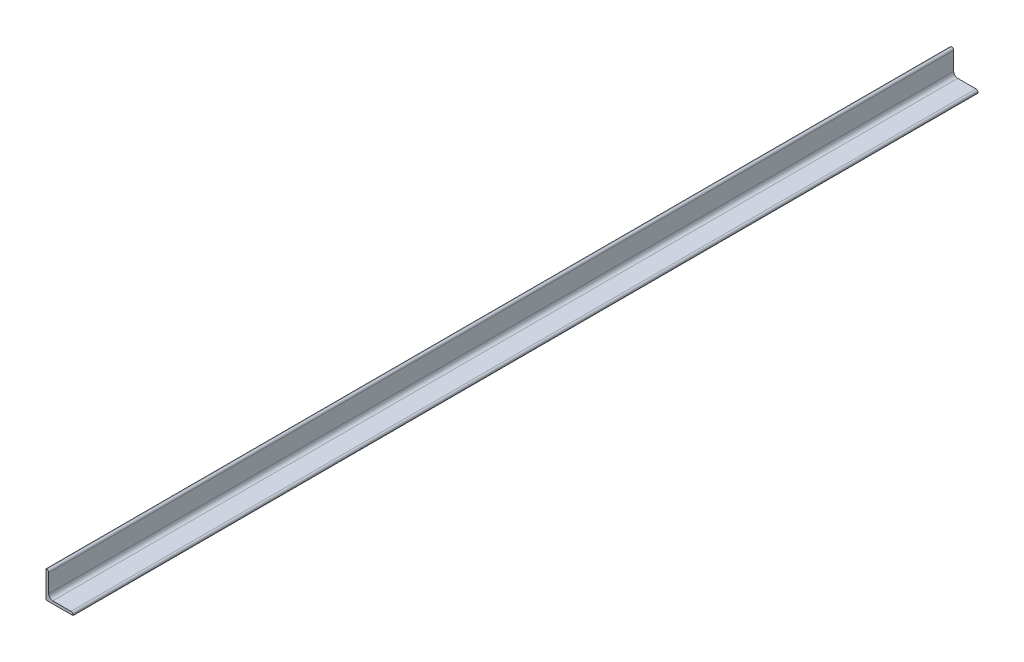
ISO-10303-21;
HEADER;
FILE_DESCRIPTION(('STEP AP214'),'2;1');
FILE_NAME('part.step','',(''),(''),'','','');
FILE_SCHEMA(('AUTOMOTIVE_DESIGN { 1 0 10303 214 1 1 1 1 }'));
ENDSEC;
DATA;
#1=APPLICATION_CONTEXT('core data for automotive mechanical design processes');
#2=APPLICATION_PROTOCOL_DEFINITION('international standard','automotive_design',2000,#1);
#3=PRODUCT_CONTEXT('',#1,'mechanical');
#4=PRODUCT('Part','Part','',(#3));
#5=PRODUCT_RELATED_PRODUCT_CATEGORY('part','',(#4));
#6=PRODUCT_DEFINITION_FORMATION('','',#4);
#7=PRODUCT_DEFINITION_CONTEXT('part definition',#1,'design');
#8=PRODUCT_DEFINITION('design','',#6,#7);
#9=PRODUCT_DEFINITION_SHAPE('','',#8);
#10=(LENGTH_UNIT() NAMED_UNIT(*) SI_UNIT(.MILLI.,.METRE.));
#11=(NAMED_UNIT(*) PLANE_ANGLE_UNIT() SI_UNIT($,.RADIAN.));
#12=(NAMED_UNIT(*) SI_UNIT($,.STERADIAN.) SOLID_ANGLE_UNIT());
#13=UNCERTAINTY_MEASURE_WITH_UNIT(LENGTH_MEASURE(1.E-05),#10,'distance_accuracy_value','');
#14=(GEOMETRIC_REPRESENTATION_CONTEXT(3) GLOBAL_UNCERTAINTY_ASSIGNED_CONTEXT((#13)) GLOBAL_UNIT_ASSIGNED_CONTEXT((#10,
#11,#12)) REPRESENTATION_CONTEXT('',''));
#15=CARTESIAN_POINT('',(0.,0.,0.));
#16=DIRECTION('',(0.,0.,1.));
#17=DIRECTION('',(1.,0.,0.));
#18=AXIS2_PLACEMENT_3D('',#15,#16,#17);
#19=CARTESIAN_POINT('',(20.,-20.,670.));
#20=DIRECTION('',(0.,1.,0.));
#21=DIRECTION('',(0.,0.,1.));
#22=AXIS2_PLACEMENT_3D('',#19,#20,#21);
#23=PLANE('',#22);
#24=DIRECTION('',(1.,0.,0.));
#25=VECTOR('',#24,1.);
#26=CARTESIAN_POINT('',(20.,-20.,-670.));
#27=LINE('',#26,#25);
#28=CARTESIAN_POINT('',(-20.,-20.,-670.));
#29=VERTEX_POINT('',#28);
#30=CARTESIAN_POINT('',(20.,-20.,-670.));
#31=VERTEX_POINT('',#30);
#32=EDGE_CURVE('E138',#29,#31,#27,.T.);
#33=ORIENTED_EDGE('',*,*,#32,.T.);
#34=DIRECTION('',(0.,0.,-1.));
#35=VECTOR('',#34,1.);
#36=CARTESIAN_POINT('',(20.,-20.,670.));
#37=LINE('',#36,#35);
#38=CARTESIAN_POINT('',(20.,-20.,670.));
#39=VERTEX_POINT('',#38);
#40=EDGE_CURVE('E11',#39,#31,#37,.T.);
#41=ORIENTED_EDGE('',*,*,#40,.F.);
#42=DIRECTION('',(1.,0.,0.));
#43=VECTOR('',#42,1.);
#44=CARTESIAN_POINT('',(20.,-20.,670.));
#45=LINE('',#44,#43);
#46=CARTESIAN_POINT('',(-20.,-20.,670.));
#47=VERTEX_POINT('',#46);
#48=EDGE_CURVE('E154',#47,#39,#45,.T.);
#49=ORIENTED_EDGE('',*,*,#48,.F.);
#50=DIRECTION('',(0.,0.,-1.));
#51=VECTOR('',#50,1.);
#52=CARTESIAN_POINT('',(-20.,-20.,670.));
#53=LINE('',#52,#51);
#54=EDGE_CURVE('E134',#47,#29,#53,.T.);
#55=ORIENTED_EDGE('',*,*,#54,.T.);
#56=EDGE_LOOP('',(#33,#41,#49,#55));
#57=FACE_BOUND('',#56,.T.);
#58=ADVANCED_FACE('F36',(#57),#23,.F.);
#59=CARTESIAN_POINT('',(20.,-20.,670.));
#60=DIRECTION('',(-1.,0.,0.));
#61=DIRECTION('',(0.,0.,1.));
#62=AXIS2_PLACEMENT_3D('',#59,#60,#61);
#63=PLANE('',#62);
#64=DIRECTION('',(0.,1.,0.));
#65=VECTOR('',#64,1.);
#66=CARTESIAN_POINT('',(20.,-20.,-670.));
#67=LINE('',#66,#65);
#68=CARTESIAN_POINT('',(20.,-19.,-670.));
#69=VERTEX_POINT('',#68);
#70=EDGE_CURVE('E141',#31,#69,#67,.T.);
#71=ORIENTED_EDGE('',*,*,#70,.T.);
#72=DIRECTION('',(0.,0.,-1.));
#73=VECTOR('',#72,1.);
#74=CARTESIAN_POINT('',(20.,-19.,670.));
#75=LINE('',#74,#73);
#76=CARTESIAN_POINT('',(20.,-19.,670.));
#77=VERTEX_POINT('',#76);
#78=EDGE_CURVE('E44',#77,#69,#75,.T.);
#79=ORIENTED_EDGE('',*,*,#78,.F.);
#80=DIRECTION('',(0.,1.,0.));
#81=VECTOR('',#80,1.);
#82=CARTESIAN_POINT('',(20.,-20.,670.));
#83=LINE('',#82,#81);
#84=EDGE_CURVE('E98',#39,#77,#83,.T.);
#85=ORIENTED_EDGE('',*,*,#84,.F.);
#86=ORIENTED_EDGE('',*,*,#40,.T.);
#87=EDGE_LOOP('',(#71,#79,#85,#86));
#88=FACE_BOUND('',#87,.T.);
#89=ADVANCED_FACE('F197',(#88),#63,.F.);
#90=CARTESIAN_POINT('',(17.,-19.,670.));
#91=DIRECTION('',(0.,0.,-1.));
#92=DIRECTION('',(-1.,0.,0.));
#93=AXIS2_PLACEMENT_3D('',#90,#91,#92);
#94=CYLINDRICAL_SURFACE('',#93,3.);
#95=CARTESIAN_POINT('',(17.,-19.,-670.));
#96=DIRECTION('',(0.,0.,1.));
#97=DIRECTION('',(1.,0.,0.));
#98=AXIS2_PLACEMENT_3D('',#95,#96,#97);
#99=CIRCLE('',#98,3.);
#100=CARTESIAN_POINT('',(17.,-16.,-670.));
#101=VERTEX_POINT('',#100);
#102=EDGE_CURVE('E143',#69,#101,#99,.T.);
#103=ORIENTED_EDGE('',*,*,#102,.T.);
#104=DIRECTION('',(0.,0.,-1.));
#105=VECTOR('',#104,1.);
#106=CARTESIAN_POINT('',(17.,-16.,670.));
#107=LINE('',#106,#105);
#108=CARTESIAN_POINT('',(17.,-16.,670.));
#109=VERTEX_POINT('',#108);
#110=EDGE_CURVE('E164',#109,#101,#107,.T.);
#111=ORIENTED_EDGE('',*,*,#110,.F.);
#112=CARTESIAN_POINT('',(17.,-19.,670.));
#113=DIRECTION('',(0.,0.,1.));
#114=DIRECTION('',(1.,0.,0.));
#115=AXIS2_PLACEMENT_3D('',#112,#113,#114);
#116=CIRCLE('',#115,3.);
#117=EDGE_CURVE('E172',#77,#109,#116,.T.);
#118=ORIENTED_EDGE('',*,*,#117,.F.);
#119=ORIENTED_EDGE('',*,*,#78,.T.);
#120=EDGE_LOOP('',(#103,#111,#118,#119));
#121=FACE_BOUND('',#120,.T.);
#122=ADVANCED_FACE('F170',(#121),#94,.T.);
#123=CARTESIAN_POINT('',(-10.,-16.,670.));
#124=DIRECTION('',(0.,-1.,0.));
#125=DIRECTION('',(0.,0.,-1.));
#126=AXIS2_PLACEMENT_3D('',#123,#124,#125);
#127=PLANE('',#126);
#128=DIRECTION('',(-1.,0.,0.));
#129=VECTOR('',#128,1.);
#130=CARTESIAN_POINT('',(-10.,-16.,-670.));
#131=LINE('',#130,#129);
#132=CARTESIAN_POINT('',(-10.,-16.,-670.));
#133=VERTEX_POINT('',#132);
#134=EDGE_CURVE('E145',#101,#133,#131,.T.);
#135=ORIENTED_EDGE('',*,*,#134,.T.);
#136=DIRECTION('',(0.,0.,-1.));
#137=VECTOR('',#136,1.);
#138=CARTESIAN_POINT('',(-10.,-16.,670.));
#139=LINE('',#138,#137);
#140=CARTESIAN_POINT('',(-10.,-16.,670.));
#141=VERTEX_POINT('',#140);
#142=EDGE_CURVE('E161',#141,#133,#139,.T.);
#143=ORIENTED_EDGE('',*,*,#142,.F.);
#144=DIRECTION('',(-1.,0.,0.));
#145=VECTOR('',#144,1.);
#146=CARTESIAN_POINT('',(-10.,-16.,670.));
#147=LINE('',#146,#145);
#148=EDGE_CURVE('E188',#109,#141,#147,.T.);
#149=ORIENTED_EDGE('',*,*,#148,.F.);
#150=ORIENTED_EDGE('',*,*,#110,.T.);
#151=EDGE_LOOP('',(#135,#143,#149,#150));
#152=FACE_BOUND('',#151,.T.);
#153=ADVANCED_FACE('F181',(#152),#127,.F.);
#154=CARTESIAN_POINT('',(-10.,-10.,670.));
#155=DIRECTION('',(0.,0.,-1.));
#156=DIRECTION('',(-1.,0.,0.));
#157=AXIS2_PLACEMENT_3D('',#154,#155,#156);
#158=CYLINDRICAL_SURFACE('',#157,6.);
#159=CARTESIAN_POINT('',(-10.,-10.,-670.));
#160=DIRECTION('',(0.,0.,-1.));
#161=DIRECTION('',(-1.,0.,0.));
#162=AXIS2_PLACEMENT_3D('',#159,#160,#161);
#163=CIRCLE('',#162,6.);
#164=CARTESIAN_POINT('',(-16.,-10.,-670.));
#165=VERTEX_POINT('',#164);
#166=EDGE_CURVE('E147',#133,#165,#163,.T.);
#167=ORIENTED_EDGE('',*,*,#166,.T.);
#168=DIRECTION('',(0.,0.,-1.));
#169=VECTOR('',#168,1.);
#170=CARTESIAN_POINT('',(-16.,-10.,670.));
#171=LINE('',#170,#169);
#172=CARTESIAN_POINT('',(-16.,-10.,670.));
#173=VERTEX_POINT('',#172);
#174=EDGE_CURVE('E158',#173,#165,#171,.T.);
#175=ORIENTED_EDGE('',*,*,#174,.F.);
#176=CARTESIAN_POINT('',(-10.,-10.,670.));
#177=DIRECTION('',(0.,0.,-1.));
#178=DIRECTION('',(-1.,0.,0.));
#179=AXIS2_PLACEMENT_3D('',#176,#177,#178);
#180=CIRCLE('',#179,6.);
#181=EDGE_CURVE('E187',#141,#173,#180,.T.);
#182=ORIENTED_EDGE('',*,*,#181,.F.);
#183=ORIENTED_EDGE('',*,*,#142,.T.);
#184=EDGE_LOOP('',(#167,#175,#182,#183));
#185=FACE_BOUND('',#184,.T.);
#186=ADVANCED_FACE('F185',(#185),#158,.F.);
#187=CARTESIAN_POINT('',(-16.,17.,670.));
#188=DIRECTION('',(-1.,0.,0.));
#189=DIRECTION('',(0.,-1.,0.));
#190=AXIS2_PLACEMENT_3D('',#187,#188,#189);
#191=PLANE('',#190);
#192=DIRECTION('',(0.,1.,0.));
#193=VECTOR('',#192,1.);
#194=CARTESIAN_POINT('',(-16.,17.,-670.));
#195=LINE('',#194,#193);
#196=CARTESIAN_POINT('',(-16.,17.,-670.));
#197=VERTEX_POINT('',#196);
#198=EDGE_CURVE('E149',#165,#197,#195,.T.);
#199=ORIENTED_EDGE('',*,*,#198,.T.);
#200=DIRECTION('',(0.,0.,-1.));
#201=VECTOR('',#200,1.);
#202=CARTESIAN_POINT('',(-16.,17.,670.));
#203=LINE('',#202,#201);
#204=CARTESIAN_POINT('',(-16.,17.,670.));
#205=VERTEX_POINT('',#204);
#206=EDGE_CURVE('E129',#205,#197,#203,.T.);
#207=ORIENTED_EDGE('',*,*,#206,.F.);
#208=DIRECTION('',(0.,1.,0.));
#209=VECTOR('',#208,1.);
#210=CARTESIAN_POINT('',(-16.,17.,670.));
#211=LINE('',#210,#209);
#212=EDGE_CURVE('E120',#173,#205,#211,.T.);
#213=ORIENTED_EDGE('',*,*,#212,.F.);
#214=ORIENTED_EDGE('',*,*,#174,.T.);
#215=EDGE_LOOP('',(#199,#207,#213,#214));
#216=FACE_BOUND('',#215,.T.);
#217=ADVANCED_FACE('F209',(#216),#191,.F.);
#218=CARTESIAN_POINT('',(-19.,17.,670.));
#219=DIRECTION('',(0.,0.,-1.));
#220=DIRECTION('',(-1.,0.,0.));
#221=AXIS2_PLACEMENT_3D('',#218,#219,#220);
#222=CYLINDRICAL_SURFACE('',#221,3.);
#223=CARTESIAN_POINT('',(-19.,17.,-670.));
#224=DIRECTION('',(0.,0.,1.));
#225=DIRECTION('',(-1.,0.,0.));
#226=AXIS2_PLACEMENT_3D('',#223,#224,#225);
#227=CIRCLE('',#226,3.);
#228=CARTESIAN_POINT('',(-19.,20.,-670.));
#229=VERTEX_POINT('',#228);
#230=EDGE_CURVE('E128',#197,#229,#227,.T.);
#231=ORIENTED_EDGE('',*,*,#230,.T.);
#232=DIRECTION('',(0.,0.,-1.));
#233=VECTOR('',#232,1.);
#234=CARTESIAN_POINT('',(-19.,20.,670.));
#235=LINE('',#234,#233);
#236=CARTESIAN_POINT('',(-19.,20.,670.));
#237=VERTEX_POINT('',#236);
#238=EDGE_CURVE('E125',#237,#229,#235,.T.);
#239=ORIENTED_EDGE('',*,*,#238,.F.);
#240=CARTESIAN_POINT('',(-19.,17.,670.));
#241=DIRECTION('',(0.,0.,1.));
#242=DIRECTION('',(-1.,0.,0.));
#243=AXIS2_PLACEMENT_3D('',#240,#241,#242);
#244=CIRCLE('',#243,3.);
#245=EDGE_CURVE('E114',#205,#237,#244,.T.);
#246=ORIENTED_EDGE('',*,*,#245,.F.);
#247=ORIENTED_EDGE('',*,*,#206,.T.);
#248=EDGE_LOOP('',(#231,#239,#246,#247));
#249=FACE_BOUND('',#248,.T.);
#250=ADVANCED_FACE('F126',(#249),#222,.T.);
#251=CARTESIAN_POINT('',(-20.,20.,670.));
#252=DIRECTION('',(0.,-1.,0.));
#253=DIRECTION('',(1.,0.,0.));
#254=AXIS2_PLACEMENT_3D('',#251,#252,#253);
#255=PLANE('',#254);
#256=DIRECTION('',(-1.,0.,0.));
#257=VECTOR('',#256,1.);
#258=CARTESIAN_POINT('',(-20.,20.,-670.));
#259=LINE('',#258,#257);
#260=CARTESIAN_POINT('',(-20.,20.,-670.));
#261=VERTEX_POINT('',#260);
#262=EDGE_CURVE('E84',#229,#261,#259,.T.);
#263=ORIENTED_EDGE('',*,*,#262,.T.);
#264=DIRECTION('',(0.,0.,-1.));
#265=VECTOR('',#264,1.);
#266=CARTESIAN_POINT('',(-20.,20.,670.));
#267=LINE('',#266,#265);
#268=CARTESIAN_POINT('',(-20.,20.,670.));
#269=VERTEX_POINT('',#268);
#270=EDGE_CURVE('E130',#269,#261,#267,.T.);
#271=ORIENTED_EDGE('',*,*,#270,.F.);
#272=DIRECTION('',(-1.,0.,0.));
#273=VECTOR('',#272,1.);
#274=CARTESIAN_POINT('',(-20.,20.,670.));
#275=LINE('',#274,#273);
#276=EDGE_CURVE('E118',#237,#269,#275,.T.);
#277=ORIENTED_EDGE('',*,*,#276,.F.);
#278=ORIENTED_EDGE('',*,*,#238,.T.);
#279=EDGE_LOOP('',(#263,#271,#277,#278));
#280=FACE_BOUND('',#279,.T.);
#281=ADVANCED_FACE('F132',(#280),#255,.F.);
#282=CARTESIAN_POINT('',(-20.,-20.,670.));
#283=DIRECTION('',(1.,0.,0.));
#284=DIRECTION('',(0.,0.,-1.));
#285=AXIS2_PLACEMENT_3D('',#282,#283,#284);
#286=PLANE('',#285);
#287=DIRECTION('',(0.,-1.,0.));
#288=VECTOR('',#287,1.);
#289=CARTESIAN_POINT('',(-20.,-20.,-670.));
#290=LINE('',#289,#288);
#291=EDGE_CURVE('E90',#261,#29,#290,.T.);
#292=ORIENTED_EDGE('',*,*,#291,.T.);
#293=ORIENTED_EDGE('',*,*,#54,.F.);
#294=DIRECTION('',(0.,-1.,0.));
#295=VECTOR('',#294,1.);
#296=CARTESIAN_POINT('',(-20.,-20.,670.));
#297=LINE('',#296,#295);
#298=EDGE_CURVE('E52',#269,#47,#297,.T.);
#299=ORIENTED_EDGE('',*,*,#298,.F.);
#300=ORIENTED_EDGE('',*,*,#270,.T.);
#301=EDGE_LOOP('',(#292,#293,#299,#300));
#302=FACE_BOUND('',#301,.T.);
#303=ADVANCED_FACE('F217',(#302),#286,.F.);
#304=CARTESIAN_POINT('',(-19.,17.,670.));
#305=DIRECTION('',(0.,0.,-1.));
#306=DIRECTION('',(-1.,0.,0.));
#307=AXIS2_PLACEMENT_3D('',#304,#305,#306);
#308=PLANE('',#307);
#309=ORIENTED_EDGE('',*,*,#48,.T.);
#310=ORIENTED_EDGE('',*,*,#84,.T.);
#311=ORIENTED_EDGE('',*,*,#117,.T.);
#312=ORIENTED_EDGE('',*,*,#148,.T.);
#313=ORIENTED_EDGE('',*,*,#181,.T.);
#314=ORIENTED_EDGE('',*,*,#212,.T.);
#315=ORIENTED_EDGE('',*,*,#245,.T.);
#316=ORIENTED_EDGE('',*,*,#276,.T.);
#317=ORIENTED_EDGE('',*,*,#298,.T.);
#318=EDGE_LOOP('',(#309,#310,#311,#312,#313,#314,#315,#316,#317));
#319=FACE_BOUND('',#318,.T.);
#320=ADVANCED_FACE('F116',(#319),#308,.F.);
#321=CARTESIAN_POINT('',(-19.,17.,-670.));
#322=DIRECTION('',(0.,0.,-1.));
#323=DIRECTION('',(-1.,0.,0.));
#324=AXIS2_PLACEMENT_3D('',#321,#322,#323);
#325=PLANE('',#324);
#326=ORIENTED_EDGE('',*,*,#32,.F.);
#327=ORIENTED_EDGE('',*,*,#291,.F.);
#328=ORIENTED_EDGE('',*,*,#262,.F.);
#329=ORIENTED_EDGE('',*,*,#230,.F.);
#330=ORIENTED_EDGE('',*,*,#198,.F.);
#331=ORIENTED_EDGE('',*,*,#166,.F.);
#332=ORIENTED_EDGE('',*,*,#134,.F.);
#333=ORIENTED_EDGE('',*,*,#102,.F.);
#334=ORIENTED_EDGE('',*,*,#70,.F.);
#335=EDGE_LOOP('',(#326,#327,#328,#329,#330,#331,#332,#333,#334));
#336=FACE_BOUND('',#335,.T.);
#337=ADVANCED_FACE('F176',(#336),#325,.T.);
#338=CLOSED_SHELL('',(#58,#89,#122,#153,#186,#217,#250,#281,#303,#320,#337));
#339=MANIFOLD_SOLID_BREP('B2',#338);
#340=ADVANCED_BREP_SHAPE_REPRESENTATION('',(#18,#339),#14);
#341=SHAPE_DEFINITION_REPRESENTATION(#9,#340);
ENDSEC;
END-ISO-10303-21;
